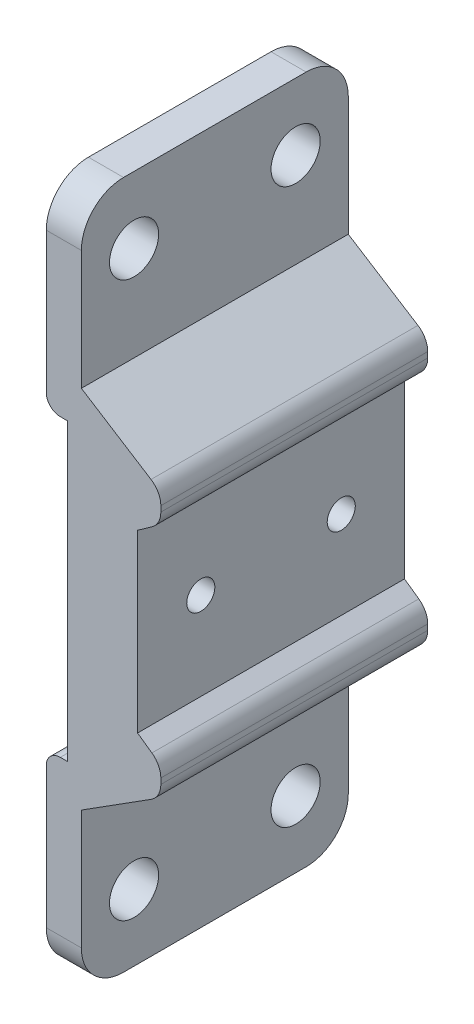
ISO-10303-21;
HEADER;
FILE_DESCRIPTION(('STEP AP214'),'2;1');
FILE_NAME('part.step','',(''),(''),'','','');
FILE_SCHEMA(('AUTOMOTIVE_DESIGN { 1 0 10303 214 1 1 1 1 }'));
ENDSEC;
DATA;
#1=APPLICATION_CONTEXT('core data for automotive mechanical design processes');
#2=APPLICATION_PROTOCOL_DEFINITION('international standard','automotive_design',2000,#1);
#3=PRODUCT_CONTEXT('',#1,'mechanical');
#4=PRODUCT('Part','Part','',(#3));
#5=PRODUCT_RELATED_PRODUCT_CATEGORY('part','',(#4));
#6=PRODUCT_DEFINITION_FORMATION('','',#4);
#7=PRODUCT_DEFINITION_CONTEXT('part definition',#1,'design');
#8=PRODUCT_DEFINITION('design','',#6,#7);
#9=PRODUCT_DEFINITION_SHAPE('','',#8);
#10=(LENGTH_UNIT() NAMED_UNIT(*) SI_UNIT(.MILLI.,.METRE.));
#11=(NAMED_UNIT(*) PLANE_ANGLE_UNIT() SI_UNIT($,.RADIAN.));
#12=(NAMED_UNIT(*) SI_UNIT($,.STERADIAN.) SOLID_ANGLE_UNIT());
#13=UNCERTAINTY_MEASURE_WITH_UNIT(LENGTH_MEASURE(1.E-05),#10,'distance_accuracy_value','');
#14=(GEOMETRIC_REPRESENTATION_CONTEXT(3) GLOBAL_UNCERTAINTY_ASSIGNED_CONTEXT((#13)) GLOBAL_UNIT_ASSIGNED_CONTEXT((#10,
#11,#12)) REPRESENTATION_CONTEXT('',''));
#15=CARTESIAN_POINT('',(0.,0.,0.));
#16=DIRECTION('',(0.,0.,1.));
#17=DIRECTION('',(1.,0.,0.));
#18=AXIS2_PLACEMENT_3D('',#15,#16,#17);
#19=CARTESIAN_POINT('',(3.00000000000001,-21.,19.));
#20=DIRECTION('',(1.,0.,0.));
#21=DIRECTION('',(0.,0.,-1.));
#22=AXIS2_PLACEMENT_3D('',#19,#20,#21);
#23=PLANE('',#22);
#24=DIRECTION('',(0.,1.,0.));
#25=VECTOR('',#24,1.);
#26=CARTESIAN_POINT('',(3.00000000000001,-21.,16.));
#27=LINE('',#26,#25);
#28=CARTESIAN_POINT('',(3.00000000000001,-21.,16.));
#29=VERTEX_POINT('',#28);
#30=CARTESIAN_POINT('',(3.00000000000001,21.,16.));
#31=VERTEX_POINT('',#30);
#32=EDGE_CURVE('E247',#29,#31,#27,.T.);
#33=ORIENTED_EDGE('',*,*,#32,.F.);
#34=DIRECTION('',(0.,0.,-1.));
#35=VECTOR('',#34,1.);
#36=CARTESIAN_POINT('',(3.00000000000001,-21.,19.));
#37=LINE('',#36,#35);
#38=CARTESIAN_POINT('',(3.00000000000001,-21.,19.));
#39=VERTEX_POINT('',#38);
#40=EDGE_CURVE('E257',#39,#29,#37,.T.);
#41=ORIENTED_EDGE('',*,*,#40,.F.);
#42=DIRECTION('',(0.,-1.,0.));
#43=VECTOR('',#42,1.);
#44=CARTESIAN_POINT('',(3.00000000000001,-21.,19.));
#45=LINE('',#44,#43);
#46=CARTESIAN_POINT('',(3.00000000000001,21.,19.));
#47=VERTEX_POINT('',#46);
#48=EDGE_CURVE('E433',#47,#39,#45,.T.);
#49=ORIENTED_EDGE('',*,*,#48,.F.);
#50=DIRECTION('',(0.,0.,-1.));
#51=VECTOR('',#50,1.);
#52=CARTESIAN_POINT('',(3.00000000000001,21.,19.));
#53=LINE('',#52,#51);
#54=EDGE_CURVE('E260',#47,#31,#53,.T.);
#55=ORIENTED_EDGE('',*,*,#54,.T.);
#56=EDGE_LOOP('',(#33,#41,#49,#55));
#57=FACE_BOUND('',#56,.T.);
#58=ADVANCED_FACE('F33',(#57),#23,.F.);
#59=CARTESIAN_POINT('',(0.,21.,19.));
#60=DIRECTION('',(1.,0.,0.));
#61=DIRECTION('',(0.,1.,0.));
#62=AXIS2_PLACEMENT_3D('',#59,#60,#61);
#63=PLANE('',#62);
#64=CARTESIAN_POINT('',(0.,39.5,-11.5));
#65=DIRECTION('',(-1.,0.,0.));
#66=DIRECTION('',(0.,1.,0.));
#67=AXIS2_PLACEMENT_3D('',#64,#65,#66);
#68=CIRCLE('',#67,3.5);
#69=CARTESIAN_POINT('',(0.,43.,-11.5));
#70=VERTEX_POINT('',#69);
#71=EDGE_CURVE('E312',#70,#70,#68,.T.);
#72=ORIENTED_EDGE('',*,*,#71,.F.);
#73=EDGE_LOOP('',(#72));
#74=FACE_BOUND('',#73,.T.);
#75=CARTESIAN_POINT('',(0.,39.5,11.5));
#76=DIRECTION('',(-1.,0.,0.));
#77=DIRECTION('',(0.,-1.,0.));
#78=AXIS2_PLACEMENT_3D('',#75,#76,#77);
#79=CIRCLE('',#78,3.5);
#80=CARTESIAN_POINT('',(0.,36.,11.5));
#81=VERTEX_POINT('',#80);
#82=EDGE_CURVE('E304',#81,#81,#79,.T.);
#83=ORIENTED_EDGE('',*,*,#82,.F.);
#84=EDGE_LOOP('',(#83));
#85=FACE_BOUND('',#84,.T.);
#86=DIRECTION('',(0.,-1.,0.));
#87=VECTOR('',#86,1.);
#88=CARTESIAN_POINT('',(0.,21.,19.));
#89=LINE('',#88,#87);
#90=CARTESIAN_POINT('',(0.,43.,19.));
#91=VERTEX_POINT('',#90);
#92=CARTESIAN_POINT('',(0.,23.,19.));
#93=VERTEX_POINT('',#92);
#94=EDGE_CURVE('E437',#91,#93,#89,.T.);
#95=ORIENTED_EDGE('',*,*,#94,.F.);
#96=CARTESIAN_POINT('',(0.,43.,13.));
#97=DIRECTION('',(1.,0.,0.));
#98=DIRECTION('',(0.,1.,0.));
#99=AXIS2_PLACEMENT_3D('',#96,#97,#98);
#100=CIRCLE('',#99,6.);
#101=CARTESIAN_POINT('',(0.,49.,13.));
#102=VERTEX_POINT('',#101);
#103=EDGE_CURVE('E328',#91,#102,#100,.F.);
#104=ORIENTED_EDGE('',*,*,#103,.T.);
#105=DIRECTION('',(0.,0.,-1.));
#106=VECTOR('',#105,1.);
#107=CARTESIAN_POINT('',(0.,49.,19.));
#108=LINE('',#107,#106);
#109=CARTESIAN_POINT('',(0.,49.,-13.));
#110=VERTEX_POINT('',#109);
#111=EDGE_CURVE('E399',#102,#110,#108,.T.);
#112=ORIENTED_EDGE('',*,*,#111,.T.);
#113=CARTESIAN_POINT('',(0.,43.,-13.));
#114=DIRECTION('',(1.,0.,0.));
#115=DIRECTION('',(0.,1.,0.));
#116=AXIS2_PLACEMENT_3D('',#113,#114,#115);
#117=CIRCLE('',#116,6.);
#118=CARTESIAN_POINT('',(0.,43.,-19.));
#119=VERTEX_POINT('',#118);
#120=EDGE_CURVE('E326',#110,#119,#117,.F.);
#121=ORIENTED_EDGE('',*,*,#120,.T.);
#122=DIRECTION('',(0.,-1.,0.));
#123=VECTOR('',#122,1.);
#124=CARTESIAN_POINT('',(0.,21.,-19.));
#125=LINE('',#124,#123);
#126=CARTESIAN_POINT('',(0.,23.,-19.));
#127=VERTEX_POINT('',#126);
#128=EDGE_CURVE('E475',#119,#127,#125,.T.);
#129=ORIENTED_EDGE('',*,*,#128,.T.);
#130=DIRECTION('',(0.,0.,-1.));
#131=VECTOR('',#130,1.);
#132=CARTESIAN_POINT('',(0.,23.,19.));
#133=LINE('',#132,#131);
#134=EDGE_CURVE('E285',#127,#93,#133,.F.);
#135=ORIENTED_EDGE('',*,*,#134,.T.);
#136=EDGE_LOOP('',(#95,#104,#112,#121,#129,#135));
#137=FACE_BOUND('',#136,.T.);
#138=ADVANCED_FACE('F35',(#74,#85,#137),#63,.F.);
#139=CARTESIAN_POINT('',(3.00000000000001,21.,19.));
#140=DIRECTION('',(0.,1.,0.));
#141=DIRECTION('',(-1.,0.,0.));
#142=AXIS2_PLACEMENT_3D('',#139,#140,#141);
#143=PLANE('',#142);
#144=DIRECTION('',(1.,0.,0.));
#145=VECTOR('',#144,1.);
#146=CARTESIAN_POINT('',(3.00000000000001,21.,19.));
#147=LINE('',#146,#145);
#148=CARTESIAN_POINT('',(2.,21.,19.));
#149=VERTEX_POINT('',#148);
#150=EDGE_CURVE('E435',#149,#47,#147,.T.);
#151=ORIENTED_EDGE('',*,*,#150,.F.);
#152=DIRECTION('',(0.,0.,-1.));
#153=VECTOR('',#152,1.);
#154=CARTESIAN_POINT('',(2.,21.,19.));
#155=LINE('',#154,#153);
#156=CARTESIAN_POINT('',(2.,21.,-19.));
#157=VERTEX_POINT('',#156);
#158=EDGE_CURVE('E277',#149,#157,#155,.T.);
#159=ORIENTED_EDGE('',*,*,#158,.T.);
#160=DIRECTION('',(1.,0.,0.));
#161=VECTOR('',#160,1.);
#162=CARTESIAN_POINT('',(3.00000000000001,21.,-19.));
#163=LINE('',#162,#161);
#164=CARTESIAN_POINT('',(3.00000000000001,21.,-19.));
#165=VERTEX_POINT('',#164);
#166=EDGE_CURVE('E473',#157,#165,#163,.T.);
#167=ORIENTED_EDGE('',*,*,#166,.T.);
#168=CARTESIAN_POINT('',(3.00000000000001,21.,-16.));
#169=VERTEX_POINT('',#168);
#170=EDGE_CURVE('E268',#169,#165,#53,.T.);
#171=ORIENTED_EDGE('',*,*,#170,.F.);
#172=DIRECTION('',(0.,0.,1.));
#173=VECTOR('',#172,1.);
#174=CARTESIAN_POINT('',(3.00000000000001,21.,-16.));
#175=LINE('',#174,#173);
#176=EDGE_CURVE('E262',#169,#31,#175,.T.);
#177=ORIENTED_EDGE('',*,*,#176,.T.);
#178=ORIENTED_EDGE('',*,*,#54,.F.);
#179=EDGE_LOOP('',(#151,#159,#167,#171,#177,#178));
#180=FACE_BOUND('',#179,.T.);
#181=ADVANCED_FACE('F598',(#180),#143,.F.);
#182=CARTESIAN_POINT('',(3.00000000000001,-21.,-16.));
#183=VERTEX_POINT('',#182);
#184=CARTESIAN_POINT('',(3.00000000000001,-21.,-19.));
#185=VERTEX_POINT('',#184);
#186=EDGE_CURVE('E269',#183,#185,#37,.T.);
#187=ORIENTED_EDGE('',*,*,#186,.F.);
#188=DIRECTION('',(0.,1.,0.));
#189=VECTOR('',#188,1.);
#190=CARTESIAN_POINT('',(3.00000000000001,-21.,-16.));
#191=LINE('',#190,#189);
#192=EDGE_CURVE('E261',#183,#169,#191,.T.);
#193=ORIENTED_EDGE('',*,*,#192,.T.);
#194=ORIENTED_EDGE('',*,*,#170,.T.);
#195=DIRECTION('',(0.,-1.,0.));
#196=VECTOR('',#195,1.);
#197=CARTESIAN_POINT('',(3.00000000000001,-21.,-19.));
#198=LINE('',#197,#196);
#199=EDGE_CURVE('E470',#165,#185,#198,.T.);
#200=ORIENTED_EDGE('',*,*,#199,.T.);
#201=EDGE_LOOP('',(#187,#193,#194,#200));
#202=FACE_BOUND('',#201,.T.);
#203=ADVANCED_FACE('F621',(#202),#23,.F.);
#204=CARTESIAN_POINT('',(3.00000000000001,-21.,19.));
#205=DIRECTION('',(0.,-1.,0.));
#206=DIRECTION('',(1.,0.,0.));
#207=AXIS2_PLACEMENT_3D('',#204,#205,#206);
#208=PLANE('',#207);
#209=DIRECTION('',(-1.,0.,0.));
#210=VECTOR('',#209,1.);
#211=CARTESIAN_POINT('',(3.00000000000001,-21.,-19.));
#212=LINE('',#211,#210);
#213=CARTESIAN_POINT('',(2.,-21.,-19.));
#214=VERTEX_POINT('',#213);
#215=EDGE_CURVE('E468',#185,#214,#212,.T.);
#216=ORIENTED_EDGE('',*,*,#215,.T.);
#217=DIRECTION('',(0.,0.,-1.));
#218=VECTOR('',#217,1.);
#219=CARTESIAN_POINT('',(2.,-21.,19.));
#220=LINE('',#219,#218);
#221=CARTESIAN_POINT('',(2.,-21.,19.));
#222=VERTEX_POINT('',#221);
#223=EDGE_CURVE('E295',#214,#222,#220,.F.);
#224=ORIENTED_EDGE('',*,*,#223,.T.);
#225=DIRECTION('',(-1.,0.,0.));
#226=VECTOR('',#225,1.);
#227=CARTESIAN_POINT('',(3.00000000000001,-21.,19.));
#228=LINE('',#227,#226);
#229=EDGE_CURVE('E267',#39,#222,#228,.T.);
#230=ORIENTED_EDGE('',*,*,#229,.F.);
#231=ORIENTED_EDGE('',*,*,#40,.T.);
#232=DIRECTION('',(0.,0.,1.));
#233=VECTOR('',#232,1.);
#234=CARTESIAN_POINT('',(3.00000000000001,-21.,-16.));
#235=LINE('',#234,#233);
#236=EDGE_CURVE('E230',#183,#29,#235,.T.);
#237=ORIENTED_EDGE('',*,*,#236,.F.);
#238=ORIENTED_EDGE('',*,*,#186,.T.);
#239=EDGE_LOOP('',(#216,#224,#230,#231,#237,#238));
#240=FACE_BOUND('',#239,.T.);
#241=ADVANCED_FACE('F265',(#240),#208,.F.);
#242=CARTESIAN_POINT('',(0.,-21.,19.));
#243=DIRECTION('',(1.,0.,0.));
#244=DIRECTION('',(0.,1.,0.));
#245=AXIS2_PLACEMENT_3D('',#242,#243,#244);
#246=PLANE('',#245);
#247=CARTESIAN_POINT('',(0.,-39.5,-11.5));
#248=DIRECTION('',(-1.,0.,0.));
#249=DIRECTION('',(0.,1.,0.));
#250=AXIS2_PLACEMENT_3D('',#247,#248,#249);
#251=CIRCLE('',#250,3.5);
#252=CARTESIAN_POINT('',(0.,-36.,-11.5));
#253=VERTEX_POINT('',#252);
#254=EDGE_CURVE('E320',#253,#253,#251,.T.);
#255=ORIENTED_EDGE('',*,*,#254,.F.);
#256=EDGE_LOOP('',(#255));
#257=FACE_BOUND('',#256,.T.);
#258=CARTESIAN_POINT('',(0.,-39.5,11.5));
#259=DIRECTION('',(-1.,0.,0.));
#260=DIRECTION('',(0.,-1.,0.));
#261=AXIS2_PLACEMENT_3D('',#258,#259,#260);
#262=CIRCLE('',#261,3.5);
#263=CARTESIAN_POINT('',(0.,-43.,11.5));
#264=VERTEX_POINT('',#263);
#265=EDGE_CURVE('E308',#264,#264,#262,.T.);
#266=ORIENTED_EDGE('',*,*,#265,.F.);
#267=EDGE_LOOP('',(#266));
#268=FACE_BOUND('',#267,.T.);
#269=DIRECTION('',(0.,0.,-1.));
#270=VECTOR('',#269,1.);
#271=CARTESIAN_POINT('',(0.,-49.,19.));
#272=LINE('',#271,#270);
#273=CARTESIAN_POINT('',(0.,-49.,13.));
#274=VERTEX_POINT('',#273);
#275=CARTESIAN_POINT('',(0.,-49.,-13.));
#276=VERTEX_POINT('',#275);
#277=EDGE_CURVE('E273',#274,#276,#272,.T.);
#278=ORIENTED_EDGE('',*,*,#277,.F.);
#279=CARTESIAN_POINT('',(0.,-43.,13.));
#280=DIRECTION('',(1.,0.,0.));
#281=DIRECTION('',(0.,1.,0.));
#282=AXIS2_PLACEMENT_3D('',#279,#280,#281);
#283=CIRCLE('',#282,6.);
#284=CARTESIAN_POINT('',(0.,-43.,19.));
#285=VERTEX_POINT('',#284);
#286=EDGE_CURVE('E11',#274,#285,#283,.F.);
#287=ORIENTED_EDGE('',*,*,#286,.T.);
#288=DIRECTION('',(0.,-1.,0.));
#289=VECTOR('',#288,1.);
#290=CARTESIAN_POINT('',(0.,-21.,19.));
#291=LINE('',#290,#289);
#292=CARTESIAN_POINT('',(0.,-23.,19.));
#293=VERTEX_POINT('',#292);
#294=EDGE_CURVE('E429',#293,#285,#291,.T.);
#295=ORIENTED_EDGE('',*,*,#294,.F.);
#296=DIRECTION('',(0.,0.,-1.));
#297=VECTOR('',#296,1.);
#298=CARTESIAN_POINT('',(0.,-23.,19.));
#299=LINE('',#298,#297);
#300=CARTESIAN_POINT('',(0.,-23.,-19.));
#301=VERTEX_POINT('',#300);
#302=EDGE_CURVE('E292',#293,#301,#299,.T.);
#303=ORIENTED_EDGE('',*,*,#302,.T.);
#304=DIRECTION('',(0.,-1.,0.));
#305=VECTOR('',#304,1.);
#306=CARTESIAN_POINT('',(0.,-21.,-19.));
#307=LINE('',#306,#305);
#308=CARTESIAN_POINT('',(0.,-43.,-19.));
#309=VERTEX_POINT('',#308);
#310=EDGE_CURVE('E466',#301,#309,#307,.T.);
#311=ORIENTED_EDGE('',*,*,#310,.T.);
#312=CARTESIAN_POINT('',(0.,-43.,-13.));
#313=DIRECTION('',(1.,0.,0.));
#314=DIRECTION('',(0.,1.,0.));
#315=AXIS2_PLACEMENT_3D('',#312,#313,#314);
#316=CIRCLE('',#315,6.);
#317=EDGE_CURVE('E41',#309,#276,#316,.F.);
#318=ORIENTED_EDGE('',*,*,#317,.T.);
#319=EDGE_LOOP('',(#278,#287,#295,#303,#311,#318));
#320=FACE_BOUND('',#319,.T.);
#321=ADVANCED_FACE('F509',(#257,#268,#320),#246,.F.);
#322=CARTESIAN_POINT('',(0.,-49.,19.));
#323=DIRECTION('',(0.,1.,0.));
#324=DIRECTION('',(0.,0.,1.));
#325=AXIS2_PLACEMENT_3D('',#322,#323,#324);
#326=PLANE('',#325);
#327=DIRECTION('',(0.,0.,-1.));
#328=VECTOR('',#327,1.);
#329=CARTESIAN_POINT('',(5.00000000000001,-49.,19.));
#330=LINE('',#329,#328);
#331=CARTESIAN_POINT('',(5.00000000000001,-49.,13.));
#332=VERTEX_POINT('',#331);
#333=CARTESIAN_POINT('',(5.00000000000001,-49.,-13.));
#334=VERTEX_POINT('',#333);
#335=EDGE_CURVE('E353',#332,#334,#330,.T.);
#336=ORIENTED_EDGE('',*,*,#335,.F.);
#337=DIRECTION('',(1.,0.,0.));
#338=VECTOR('',#337,1.);
#339=CARTESIAN_POINT('',(0.,-49.,13.));
#340=LINE('',#339,#338);
#341=EDGE_CURVE('E54',#332,#274,#340,.F.);
#342=ORIENTED_EDGE('',*,*,#341,.T.);
#343=ORIENTED_EDGE('',*,*,#277,.T.);
#344=DIRECTION('',(1.,0.,0.));
#345=VECTOR('',#344,1.);
#346=CARTESIAN_POINT('',(0.,-49.,-13.));
#347=LINE('',#346,#345);
#348=EDGE_CURVE('E347',#276,#334,#347,.T.);
#349=ORIENTED_EDGE('',*,*,#348,.T.);
#350=EDGE_LOOP('',(#336,#342,#343,#349));
#351=FACE_BOUND('',#350,.T.);
#352=ADVANCED_FACE('F352',(#351),#326,.F.);
#353=CARTESIAN_POINT('',(5.00000000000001,-49.,19.));
#354=DIRECTION('',(-1.,0.,0.));
#355=DIRECTION('',(0.,-1.,0.));
#356=AXIS2_PLACEMENT_3D('',#353,#354,#355);
#357=PLANE('',#356);
#358=CARTESIAN_POINT('',(5.,-39.5,-11.5));
#359=DIRECTION('',(-1.,0.,0.));
#360=DIRECTION('',(0.,-1.,0.));
#361=AXIS2_PLACEMENT_3D('',#358,#359,#360);
#362=CIRCLE('',#361,3.5);
#363=CARTESIAN_POINT('',(5.,-43.,-11.5));
#364=VERTEX_POINT('',#363);
#365=EDGE_CURVE('E317',#364,#364,#362,.T.);
#366=ORIENTED_EDGE('',*,*,#365,.T.);
#367=EDGE_LOOP('',(#366));
#368=FACE_BOUND('',#367,.T.);
#369=CARTESIAN_POINT('',(5.,-39.5,11.5));
#370=DIRECTION('',(-1.,0.,0.));
#371=DIRECTION('',(0.,-1.,0.));
#372=AXIS2_PLACEMENT_3D('',#369,#370,#371);
#373=CIRCLE('',#372,3.5);
#374=CARTESIAN_POINT('',(5.,-43.,11.5));
#375=VERTEX_POINT('',#374);
#376=EDGE_CURVE('E305',#375,#375,#373,.T.);
#377=ORIENTED_EDGE('',*,*,#376,.T.);
#378=EDGE_LOOP('',(#377));
#379=FACE_BOUND('',#378,.T.);
#380=DIRECTION('',(0.,1.,0.));
#381=VECTOR('',#380,1.);
#382=CARTESIAN_POINT('',(5.00000000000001,-49.,19.));
#383=LINE('',#382,#381);
#384=CARTESIAN_POINT('',(5.00000000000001,-43.,19.));
#385=VERTEX_POINT('',#384);
#386=CARTESIAN_POINT('',(5.00000000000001,-26.,19.));
#387=VERTEX_POINT('',#386);
#388=EDGE_CURVE('E427',#385,#387,#383,.T.);
#389=ORIENTED_EDGE('',*,*,#388,.F.);
#390=CARTESIAN_POINT('',(5.00000000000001,-43.,13.));
#391=DIRECTION('',(-1.,0.,0.));
#392=DIRECTION('',(0.,-1.,0.));
#393=AXIS2_PLACEMENT_3D('',#390,#391,#392);
#394=CIRCLE('',#393,6.);
#395=EDGE_CURVE('E345',#385,#332,#394,.F.);
#396=ORIENTED_EDGE('',*,*,#395,.T.);
#397=ORIENTED_EDGE('',*,*,#335,.T.);
#398=CARTESIAN_POINT('',(5.00000000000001,-43.,-13.));
#399=DIRECTION('',(-1.,0.,0.));
#400=DIRECTION('',(0.,-1.,0.));
#401=AXIS2_PLACEMENT_3D('',#398,#399,#400);
#402=CIRCLE('',#401,6.);
#403=CARTESIAN_POINT('',(5.00000000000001,-43.,-19.));
#404=VERTEX_POINT('',#403);
#405=EDGE_CURVE('E343',#334,#404,#402,.F.);
#406=ORIENTED_EDGE('',*,*,#405,.T.);
#407=DIRECTION('',(0.,1.,0.));
#408=VECTOR('',#407,1.);
#409=CARTESIAN_POINT('',(5.00000000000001,-49.,-19.));
#410=LINE('',#409,#408);
#411=CARTESIAN_POINT('',(5.00000000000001,-26.,-19.));
#412=VERTEX_POINT('',#411);
#413=EDGE_CURVE('E464',#404,#412,#410,.T.);
#414=ORIENTED_EDGE('',*,*,#413,.T.);
#415=DIRECTION('',(0.,0.,-1.));
#416=VECTOR('',#415,1.);
#417=CARTESIAN_POINT('',(5.00000000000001,-26.,19.));
#418=LINE('',#417,#416);
#419=EDGE_CURVE('E359',#387,#412,#418,.T.);
#420=ORIENTED_EDGE('',*,*,#419,.F.);
#421=EDGE_LOOP('',(#389,#396,#397,#406,#414,#420));
#422=FACE_BOUND('',#421,.T.);
#423=ADVANCED_FACE('F357',(#368,#379,#422),#357,.F.);
#424=CARTESIAN_POINT('',(5.00000000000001,-26.,19.));
#425=DIRECTION('',(-0.535052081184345,0.844819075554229,0.));
#426=DIRECTION('',(-0.844819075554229,-0.535052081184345,0.));
#427=AXIS2_PLACEMENT_3D('',#424,#425,#426);
#428=PLANE('',#427);
#429=DIRECTION('',(0.844819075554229,0.535052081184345,0.));
#430=VECTOR('',#429,1.);
#431=CARTESIAN_POINT('',(5.00000000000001,-26.,-19.));
#432=LINE('',#431,#430);
#433=CARTESIAN_POINT('',(14.9168971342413,-19.7192984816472,-19.));
#434=VERTEX_POINT('',#433);
#435=EDGE_CURVE('E462',#412,#434,#432,.T.);
#436=ORIENTED_EDGE('',*,*,#435,.T.);
#437=DIRECTION('',(0.,0.,-1.));
#438=VECTOR('',#437,1.);
#439=CARTESIAN_POINT('',(14.9168971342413,-19.7192984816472,19.));
#440=LINE('',#439,#438);
#441=CARTESIAN_POINT('',(14.9168971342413,-19.7192984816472,19.));
#442=VERTEX_POINT('',#441);
#443=EDGE_CURVE('E361',#442,#434,#440,.T.);
#444=ORIENTED_EDGE('',*,*,#443,.F.);
#445=DIRECTION('',(0.844819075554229,0.535052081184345,0.));
#446=VECTOR('',#445,1.);
#447=CARTESIAN_POINT('',(5.00000000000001,-26.,19.));
#448=LINE('',#447,#446);
#449=EDGE_CURVE('E425',#387,#442,#448,.T.);
#450=ORIENTED_EDGE('',*,*,#449,.F.);
#451=ORIENTED_EDGE('',*,*,#419,.T.);
#452=EDGE_LOOP('',(#436,#444,#450,#451));
#453=FACE_BOUND('',#452,.T.);
#454=ADVANCED_FACE('F526',(#453),#428,.F.);
#455=CARTESIAN_POINT('',(13.3117408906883,-17.1848412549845,19.));
#456=DIRECTION('',(0.,0.,-1.));
#457=DIRECTION('',(-1.,0.,0.));
#458=AXIS2_PLACEMENT_3D('',#455,#456,#457);
#459=CYLINDRICAL_SURFACE('',#458,3.);
#460=CARTESIAN_POINT('',(13.3117408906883,-17.1848412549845,-19.));
#461=DIRECTION('',(0.,0.,1.));
#462=DIRECTION('',(-1.,0.,0.));
#463=AXIS2_PLACEMENT_3D('',#460,#461,#462);
#464=CIRCLE('',#463,3.);
#465=CARTESIAN_POINT('',(16.3117408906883,-17.1848412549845,-19.));
#466=VERTEX_POINT('',#465);
#467=EDGE_CURVE('E460',#434,#466,#464,.T.);
#468=ORIENTED_EDGE('',*,*,#467,.T.);
#469=DIRECTION('',(0.,0.,-1.));
#470=VECTOR('',#469,1.);
#471=CARTESIAN_POINT('',(16.3117408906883,-17.1848412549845,19.));
#472=LINE('',#471,#470);
#473=CARTESIAN_POINT('',(16.3117408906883,-17.1848412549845,19.));
#474=VERTEX_POINT('',#473);
#475=EDGE_CURVE('E366',#474,#466,#472,.T.);
#476=ORIENTED_EDGE('',*,*,#475,.F.);
#477=CARTESIAN_POINT('',(13.3117408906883,-17.1848412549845,19.));
#478=DIRECTION('',(0.,0.,1.));
#479=DIRECTION('',(-1.,0.,0.));
#480=AXIS2_PLACEMENT_3D('',#477,#478,#479);
#481=CIRCLE('',#480,3.);
#482=EDGE_CURVE('E423',#442,#474,#481,.T.);
#483=ORIENTED_EDGE('',*,*,#482,.F.);
#484=ORIENTED_EDGE('',*,*,#443,.T.);
#485=EDGE_LOOP('',(#468,#476,#483,#484));
#486=FACE_BOUND('',#485,.T.);
#487=ADVANCED_FACE('F532',(#486),#459,.T.);
#488=CARTESIAN_POINT('',(16.3117408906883,-17.1848412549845,19.));
#489=DIRECTION('',(-1.,0.,0.));
#490=DIRECTION('',(0.,0.,1.));
#491=AXIS2_PLACEMENT_3D('',#488,#489,#490);
#492=PLANE('',#491);
#493=DIRECTION('',(0.,1.,0.));
#494=VECTOR('',#493,1.);
#495=CARTESIAN_POINT('',(16.3117408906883,-17.1848412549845,-19.));
#496=LINE('',#495,#494);
#497=CARTESIAN_POINT('',(16.3117408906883,-16.3910567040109,-19.));
#498=VERTEX_POINT('',#497);
#499=EDGE_CURVE('E458',#466,#498,#496,.T.);
#500=ORIENTED_EDGE('',*,*,#499,.T.);
#501=DIRECTION('',(0.,0.,-1.));
#502=VECTOR('',#501,1.);
#503=CARTESIAN_POINT('',(16.3117408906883,-16.3910567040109,19.));
#504=LINE('',#503,#502);
#505=CARTESIAN_POINT('',(16.3117408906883,-16.3910567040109,19.));
#506=VERTEX_POINT('',#505);
#507=EDGE_CURVE('E369',#506,#498,#504,.T.);
#508=ORIENTED_EDGE('',*,*,#507,.F.);
#509=DIRECTION('',(0.,1.,0.));
#510=VECTOR('',#509,1.);
#511=CARTESIAN_POINT('',(16.3117408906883,-17.1848412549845,19.));
#512=LINE('',#511,#510);
#513=EDGE_CURVE('E421',#474,#506,#512,.T.);
#514=ORIENTED_EDGE('',*,*,#513,.F.);
#515=ORIENTED_EDGE('',*,*,#475,.T.);
#516=EDGE_LOOP('',(#500,#508,#514,#515));
#517=FACE_BOUND('',#516,.T.);
#518=ADVANCED_FACE('F536',(#517),#492,.F.);
#519=CARTESIAN_POINT('',(13.3117408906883,-16.3910567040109,19.));
#520=DIRECTION('',(0.,0.,-1.));
#521=DIRECTION('',(-1.,0.,0.));
#522=AXIS2_PLACEMENT_3D('',#519,#520,#521);
#523=CYLINDRICAL_SURFACE('',#522,3.);
#524=CARTESIAN_POINT('',(13.3117408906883,-16.3910567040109,-19.));
#525=DIRECTION('',(0.,0.,1.));
#526=DIRECTION('',(1.,0.,0.));
#527=AXIS2_PLACEMENT_3D('',#524,#525,#526);
#528=CIRCLE('',#527,3.);
#529=CARTESIAN_POINT('',(15.0409000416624,-13.9395248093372,-19.));
#530=VERTEX_POINT('',#529);
#531=EDGE_CURVE('E456',#498,#530,#528,.T.);
#532=ORIENTED_EDGE('',*,*,#531,.T.);
#533=DIRECTION('',(0.,0.,-1.));
#534=VECTOR('',#533,1.);
#535=CARTESIAN_POINT('',(15.0409000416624,-13.9395248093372,19.));
#536=LINE('',#535,#534);
#537=CARTESIAN_POINT('',(15.0409000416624,-13.9395248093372,19.));
#538=VERTEX_POINT('',#537);
#539=EDGE_CURVE('E372',#538,#530,#536,.T.);
#540=ORIENTED_EDGE('',*,*,#539,.F.);
#541=CARTESIAN_POINT('',(13.3117408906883,-16.3910567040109,19.));
#542=DIRECTION('',(0.,0.,1.));
#543=DIRECTION('',(1.,0.,0.));
#544=AXIS2_PLACEMENT_3D('',#541,#542,#543);
#545=CIRCLE('',#544,3.);
#546=EDGE_CURVE('E419',#506,#538,#545,.T.);
#547=ORIENTED_EDGE('',*,*,#546,.F.);
#548=ORIENTED_EDGE('',*,*,#507,.T.);
#549=EDGE_LOOP('',(#532,#540,#547,#548));
#550=FACE_BOUND('',#549,.T.);
#551=ADVANCED_FACE('F541',(#550),#523,.T.);
#552=CARTESIAN_POINT('',(15.0409000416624,-13.9395248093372,19.));
#553=DIRECTION('',(-0.57638638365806,-0.817177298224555,0.));
#554=DIRECTION('',(0.817177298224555,-0.57638638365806,0.));
#555=AXIS2_PLACEMENT_3D('',#552,#553,#554);
#556=PLANE('',#555);
#557=DIRECTION('',(-0.817177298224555,0.57638638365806,0.));
#558=VECTOR('',#557,1.);
#559=CARTESIAN_POINT('',(15.0409000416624,-13.9395248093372,-19.));
#560=LINE('',#559,#558);
#561=CARTESIAN_POINT('',(13.,-12.5,-19.));
#562=VERTEX_POINT('',#561);
#563=EDGE_CURVE('E454',#530,#562,#560,.T.);
#564=ORIENTED_EDGE('',*,*,#563,.T.);
#565=DIRECTION('',(0.,0.,-1.));
#566=VECTOR('',#565,1.);
#567=CARTESIAN_POINT('',(13.,-12.5,19.));
#568=LINE('',#567,#566);
#569=CARTESIAN_POINT('',(13.,-12.5,19.));
#570=VERTEX_POINT('',#569);
#571=EDGE_CURVE('E375',#570,#562,#568,.T.);
#572=ORIENTED_EDGE('',*,*,#571,.F.);
#573=DIRECTION('',(-0.817177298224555,0.57638638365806,0.));
#574=VECTOR('',#573,1.);
#575=CARTESIAN_POINT('',(15.0409000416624,-13.9395248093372,19.));
#576=LINE('',#575,#574);
#577=EDGE_CURVE('E417',#538,#570,#576,.T.);
#578=ORIENTED_EDGE('',*,*,#577,.F.);
#579=ORIENTED_EDGE('',*,*,#539,.T.);
#580=EDGE_LOOP('',(#564,#572,#578,#579));
#581=FACE_BOUND('',#580,.T.);
#582=ADVANCED_FACE('F547',(#581),#556,.F.);
#583=CARTESIAN_POINT('',(13.,12.5,19.));
#584=DIRECTION('',(-1.,0.,0.));
#585=DIRECTION('',(0.,0.,1.));
#586=AXIS2_PLACEMENT_3D('',#583,#584,#585);
#587=PLANE('',#586);
#588=CARTESIAN_POINT('',(13.,0.,-10.));
#589=DIRECTION('',(-1.,0.,0.));
#590=DIRECTION('',(0.,0.,1.));
#591=AXIS2_PLACEMENT_3D('',#588,#589,#590);
#592=CIRCLE('',#591,2.);
#593=CARTESIAN_POINT('',(13.,0.,-8.00000000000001));
#594=VERTEX_POINT('',#593);
#595=EDGE_CURVE('E316',#594,#594,#592,.T.);
#596=ORIENTED_EDGE('',*,*,#595,.T.);
#597=EDGE_LOOP('',(#596));
#598=FACE_BOUND('',#597,.T.);
#599=CARTESIAN_POINT('',(13.,0.,10.));
#600=DIRECTION('',(-1.,0.,0.));
#601=DIRECTION('',(0.,0.,1.));
#602=AXIS2_PLACEMENT_3D('',#599,#600,#601);
#603=CIRCLE('',#602,2.);
#604=CARTESIAN_POINT('',(13.,0.,12.));
#605=VERTEX_POINT('',#604);
#606=EDGE_CURVE('E251',#605,#605,#603,.T.);
#607=ORIENTED_EDGE('',*,*,#606,.T.);
#608=EDGE_LOOP('',(#607));
#609=FACE_BOUND('',#608,.T.);
#610=DIRECTION('',(0.,1.,0.));
#611=VECTOR('',#610,1.);
#612=CARTESIAN_POINT('',(13.,12.5,-19.));
#613=LINE('',#612,#611);
#614=CARTESIAN_POINT('',(13.,12.5,-19.));
#615=VERTEX_POINT('',#614);
#616=EDGE_CURVE('E452',#562,#615,#613,.T.);
#617=ORIENTED_EDGE('',*,*,#616,.T.);
#618=DIRECTION('',(0.,0.,-1.));
#619=VECTOR('',#618,1.);
#620=CARTESIAN_POINT('',(13.,12.5,19.));
#621=LINE('',#620,#619);
#622=CARTESIAN_POINT('',(13.,12.5,19.));
#623=VERTEX_POINT('',#622);
#624=EDGE_CURVE('E378',#623,#615,#621,.T.);
#625=ORIENTED_EDGE('',*,*,#624,.F.);
#626=DIRECTION('',(0.,1.,0.));
#627=VECTOR('',#626,1.);
#628=CARTESIAN_POINT('',(13.,12.5,19.));
#629=LINE('',#628,#627);
#630=EDGE_CURVE('E415',#570,#623,#629,.T.);
#631=ORIENTED_EDGE('',*,*,#630,.F.);
#632=ORIENTED_EDGE('',*,*,#571,.T.);
#633=EDGE_LOOP('',(#617,#625,#631,#632));
#634=FACE_BOUND('',#633,.T.);
#635=ADVANCED_FACE('F551',(#598,#609,#634),#587,.F.);
#636=CARTESIAN_POINT('',(15.0409000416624,13.9395248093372,19.));
#637=DIRECTION('',(-0.57638638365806,0.817177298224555,0.));
#638=DIRECTION('',(-0.817177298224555,-0.57638638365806,0.));
#639=AXIS2_PLACEMENT_3D('',#636,#637,#638);
#640=PLANE('',#639);
#641=DIRECTION('',(0.817177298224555,0.57638638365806,0.));
#642=VECTOR('',#641,1.);
#643=CARTESIAN_POINT('',(15.0409000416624,13.9395248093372,-19.));
#644=LINE('',#643,#642);
#645=CARTESIAN_POINT('',(15.0409000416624,13.9395248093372,-19.));
#646=VERTEX_POINT('',#645);
#647=EDGE_CURVE('E450',#615,#646,#644,.T.);
#648=ORIENTED_EDGE('',*,*,#647,.T.);
#649=DIRECTION('',(0.,0.,-1.));
#650=VECTOR('',#649,1.);
#651=CARTESIAN_POINT('',(15.0409000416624,13.9395248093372,19.));
#652=LINE('',#651,#650);
#653=CARTESIAN_POINT('',(15.0409000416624,13.9395248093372,19.));
#654=VERTEX_POINT('',#653);
#655=EDGE_CURVE('E381',#654,#646,#652,.T.);
#656=ORIENTED_EDGE('',*,*,#655,.F.);
#657=DIRECTION('',(0.817177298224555,0.57638638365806,0.));
#658=VECTOR('',#657,1.);
#659=CARTESIAN_POINT('',(15.0409000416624,13.9395248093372,19.));
#660=LINE('',#659,#658);
#661=EDGE_CURVE('E413',#623,#654,#660,.T.);
#662=ORIENTED_EDGE('',*,*,#661,.F.);
#663=ORIENTED_EDGE('',*,*,#624,.T.);
#664=EDGE_LOOP('',(#648,#656,#662,#663));
#665=FACE_BOUND('',#664,.T.);
#666=ADVANCED_FACE('F556',(#665),#640,.F.);
#667=CARTESIAN_POINT('',(13.3117408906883,16.3910567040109,19.));
#668=DIRECTION('',(0.,0.,-1.));
#669=DIRECTION('',(-1.,0.,0.));
#670=AXIS2_PLACEMENT_3D('',#667,#668,#669);
#671=CYLINDRICAL_SURFACE('',#670,3.);
#672=CARTESIAN_POINT('',(13.3117408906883,16.3910567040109,-19.));
#673=DIRECTION('',(0.,0.,1.));
#674=DIRECTION('',(-1.,0.,0.));
#675=AXIS2_PLACEMENT_3D('',#672,#673,#674);
#676=CIRCLE('',#675,3.);
#677=CARTESIAN_POINT('',(16.3117408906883,16.3910567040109,-19.));
#678=VERTEX_POINT('',#677);
#679=EDGE_CURVE('E448',#646,#678,#676,.T.);
#680=ORIENTED_EDGE('',*,*,#679,.T.);
#681=DIRECTION('',(0.,0.,-1.));
#682=VECTOR('',#681,1.);
#683=CARTESIAN_POINT('',(16.3117408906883,16.3910567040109,19.));
#684=LINE('',#683,#682);
#685=CARTESIAN_POINT('',(16.3117408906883,16.3910567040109,19.));
#686=VERTEX_POINT('',#685);
#687=EDGE_CURVE('E384',#686,#678,#684,.T.);
#688=ORIENTED_EDGE('',*,*,#687,.F.);
#689=CARTESIAN_POINT('',(13.3117408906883,16.3910567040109,19.));
#690=DIRECTION('',(0.,0.,1.));
#691=DIRECTION('',(-1.,0.,0.));
#692=AXIS2_PLACEMENT_3D('',#689,#690,#691);
#693=CIRCLE('',#692,3.);
#694=EDGE_CURVE('E411',#654,#686,#693,.T.);
#695=ORIENTED_EDGE('',*,*,#694,.F.);
#696=ORIENTED_EDGE('',*,*,#655,.T.);
#697=EDGE_LOOP('',(#680,#688,#695,#696));
#698=FACE_BOUND('',#697,.T.);
#699=ADVANCED_FACE('F562',(#698),#671,.T.);
#700=CARTESIAN_POINT('',(16.3117408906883,17.1848412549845,19.));
#701=DIRECTION('',(-1.,0.,0.));
#702=DIRECTION('',(0.,0.,1.));
#703=AXIS2_PLACEMENT_3D('',#700,#701,#702);
#704=PLANE('',#703);
#705=DIRECTION('',(0.,1.,0.));
#706=VECTOR('',#705,1.);
#707=CARTESIAN_POINT('',(16.3117408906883,17.1848412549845,-19.));
#708=LINE('',#707,#706);
#709=CARTESIAN_POINT('',(16.3117408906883,17.1848412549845,-19.));
#710=VERTEX_POINT('',#709);
#711=EDGE_CURVE('E446',#678,#710,#708,.T.);
#712=ORIENTED_EDGE('',*,*,#711,.T.);
#713=DIRECTION('',(0.,0.,-1.));
#714=VECTOR('',#713,1.);
#715=CARTESIAN_POINT('',(16.3117408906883,17.1848412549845,19.));
#716=LINE('',#715,#714);
#717=CARTESIAN_POINT('',(16.3117408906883,17.1848412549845,19.));
#718=VERTEX_POINT('',#717);
#719=EDGE_CURVE('E387',#718,#710,#716,.T.);
#720=ORIENTED_EDGE('',*,*,#719,.F.);
#721=DIRECTION('',(0.,1.,0.));
#722=VECTOR('',#721,1.);
#723=CARTESIAN_POINT('',(16.3117408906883,17.1848412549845,19.));
#724=LINE('',#723,#722);
#725=EDGE_CURVE('E409',#686,#718,#724,.T.);
#726=ORIENTED_EDGE('',*,*,#725,.F.);
#727=ORIENTED_EDGE('',*,*,#687,.T.);
#728=EDGE_LOOP('',(#712,#720,#726,#727));
#729=FACE_BOUND('',#728,.T.);
#730=ADVANCED_FACE('F566',(#729),#704,.F.);
#731=CARTESIAN_POINT('',(13.3117408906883,17.1848412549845,19.));
#732=DIRECTION('',(0.,0.,-1.));
#733=DIRECTION('',(-1.,0.,0.));
#734=AXIS2_PLACEMENT_3D('',#731,#732,#733);
#735=CYLINDRICAL_SURFACE('',#734,3.);
#736=CARTESIAN_POINT('',(13.3117408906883,17.1848412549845,-19.));
#737=DIRECTION('',(0.,0.,1.));
#738=DIRECTION('',(1.,0.,0.));
#739=AXIS2_PLACEMENT_3D('',#736,#737,#738);
#740=CIRCLE('',#739,3.);
#741=CARTESIAN_POINT('',(14.9168971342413,19.7192984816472,-19.));
#742=VERTEX_POINT('',#741);
#743=EDGE_CURVE('E444',#710,#742,#740,.T.);
#744=ORIENTED_EDGE('',*,*,#743,.T.);
#745=DIRECTION('',(0.,0.,-1.));
#746=VECTOR('',#745,1.);
#747=CARTESIAN_POINT('',(14.9168971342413,19.7192984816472,19.));
#748=LINE('',#747,#746);
#749=CARTESIAN_POINT('',(14.9168971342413,19.7192984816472,19.));
#750=VERTEX_POINT('',#749);
#751=EDGE_CURVE('E390',#750,#742,#748,.T.);
#752=ORIENTED_EDGE('',*,*,#751,.F.);
#753=CARTESIAN_POINT('',(13.3117408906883,17.1848412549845,19.));
#754=DIRECTION('',(0.,0.,1.));
#755=DIRECTION('',(1.,0.,0.));
#756=AXIS2_PLACEMENT_3D('',#753,#754,#755);
#757=CIRCLE('',#756,3.);
#758=EDGE_CURVE('E407',#718,#750,#757,.T.);
#759=ORIENTED_EDGE('',*,*,#758,.F.);
#760=ORIENTED_EDGE('',*,*,#719,.T.);
#761=EDGE_LOOP('',(#744,#752,#759,#760));
#762=FACE_BOUND('',#761,.T.);
#763=ADVANCED_FACE('F571',(#762),#735,.T.);
#764=CARTESIAN_POINT('',(5.00000000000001,26.,19.));
#765=DIRECTION('',(-0.535052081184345,-0.844819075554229,0.));
#766=DIRECTION('',(0.844819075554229,-0.535052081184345,0.));
#767=AXIS2_PLACEMENT_3D('',#764,#765,#766);
#768=PLANE('',#767);
#769=DIRECTION('',(-0.844819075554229,0.535052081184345,0.));
#770=VECTOR('',#769,1.);
#771=CARTESIAN_POINT('',(5.00000000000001,26.,-19.));
#772=LINE('',#771,#770);
#773=CARTESIAN_POINT('',(5.00000000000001,26.,-19.));
#774=VERTEX_POINT('',#773);
#775=EDGE_CURVE('E442',#742,#774,#772,.T.);
#776=ORIENTED_EDGE('',*,*,#775,.T.);
#777=DIRECTION('',(0.,0.,-1.));
#778=VECTOR('',#777,1.);
#779=CARTESIAN_POINT('',(5.00000000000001,26.,19.));
#780=LINE('',#779,#778);
#781=CARTESIAN_POINT('',(5.00000000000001,26.,19.));
#782=VERTEX_POINT('',#781);
#783=EDGE_CURVE('E393',#782,#774,#780,.T.);
#784=ORIENTED_EDGE('',*,*,#783,.F.);
#785=DIRECTION('',(-0.844819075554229,0.535052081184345,0.));
#786=VECTOR('',#785,1.);
#787=CARTESIAN_POINT('',(5.00000000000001,26.,19.));
#788=LINE('',#787,#786);
#789=EDGE_CURVE('E405',#750,#782,#788,.T.);
#790=ORIENTED_EDGE('',*,*,#789,.F.);
#791=ORIENTED_EDGE('',*,*,#751,.T.);
#792=EDGE_LOOP('',(#776,#784,#790,#791));
#793=FACE_BOUND('',#792,.T.);
#794=ADVANCED_FACE('F577',(#793),#768,.F.);
#795=CARTESIAN_POINT('',(5.00000000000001,49.,19.));
#796=DIRECTION('',(-1.,0.,0.));
#797=DIRECTION('',(0.,-1.,0.));
#798=AXIS2_PLACEMENT_3D('',#795,#796,#797);
#799=PLANE('',#798);
#800=CARTESIAN_POINT('',(5.,39.5,-11.5));
#801=DIRECTION('',(-1.,0.,0.));
#802=DIRECTION('',(0.,-1.,0.));
#803=AXIS2_PLACEMENT_3D('',#800,#801,#802);
#804=CIRCLE('',#803,3.5);
#805=CARTESIAN_POINT('',(5.00000000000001,36.,-11.5));
#806=VERTEX_POINT('',#805);
#807=EDGE_CURVE('E309',#806,#806,#804,.T.);
#808=ORIENTED_EDGE('',*,*,#807,.T.);
#809=EDGE_LOOP('',(#808));
#810=FACE_BOUND('',#809,.T.);
#811=CARTESIAN_POINT('',(5.,39.5,11.5));
#812=DIRECTION('',(-1.,0.,0.));
#813=DIRECTION('',(0.,-1.,0.));
#814=AXIS2_PLACEMENT_3D('',#811,#812,#813);
#815=CIRCLE('',#814,3.5);
#816=CARTESIAN_POINT('',(5.00000000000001,36.,11.5));
#817=VERTEX_POINT('',#816);
#818=EDGE_CURVE('E301',#817,#817,#815,.T.);
#819=ORIENTED_EDGE('',*,*,#818,.T.);
#820=EDGE_LOOP('',(#819));
#821=FACE_BOUND('',#820,.T.);
#822=DIRECTION('',(0.,0.,-1.));
#823=VECTOR('',#822,1.);
#824=CARTESIAN_POINT('',(5.00000000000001,49.,19.));
#825=LINE('',#824,#823);
#826=CARTESIAN_POINT('',(5.00000000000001,49.,13.));
#827=VERTEX_POINT('',#826);
#828=CARTESIAN_POINT('',(5.00000000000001,49.,-13.));
#829=VERTEX_POINT('',#828);
#830=EDGE_CURVE('E396',#827,#829,#825,.T.);
#831=ORIENTED_EDGE('',*,*,#830,.F.);
#832=CARTESIAN_POINT('',(5.00000000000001,43.,13.));
#833=DIRECTION('',(-1.,0.,0.));
#834=DIRECTION('',(0.,-1.,0.));
#835=AXIS2_PLACEMENT_3D('',#832,#833,#834);
#836=CIRCLE('',#835,6.);
#837=CARTESIAN_POINT('',(5.00000000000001,43.,19.));
#838=VERTEX_POINT('',#837);
#839=EDGE_CURVE('E337',#827,#838,#836,.F.);
#840=ORIENTED_EDGE('',*,*,#839,.T.);
#841=DIRECTION('',(0.,1.,0.));
#842=VECTOR('',#841,1.);
#843=CARTESIAN_POINT('',(5.00000000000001,49.,19.));
#844=LINE('',#843,#842);
#845=EDGE_CURVE('E402',#782,#838,#844,.T.);
#846=ORIENTED_EDGE('',*,*,#845,.F.);
#847=ORIENTED_EDGE('',*,*,#783,.T.);
#848=DIRECTION('',(0.,1.,0.));
#849=VECTOR('',#848,1.);
#850=CARTESIAN_POINT('',(5.00000000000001,49.,-19.));
#851=LINE('',#850,#849);
#852=CARTESIAN_POINT('',(5.00000000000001,43.,-19.));
#853=VERTEX_POINT('',#852);
#854=EDGE_CURVE('E439',#774,#853,#851,.T.);
#855=ORIENTED_EDGE('',*,*,#854,.T.);
#856=CARTESIAN_POINT('',(5.00000000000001,43.,-13.));
#857=DIRECTION('',(-1.,0.,0.));
#858=DIRECTION('',(0.,-1.,0.));
#859=AXIS2_PLACEMENT_3D('',#856,#857,#858);
#860=CIRCLE('',#859,6.);
#861=EDGE_CURVE('E335',#853,#829,#860,.F.);
#862=ORIENTED_EDGE('',*,*,#861,.T.);
#863=EDGE_LOOP('',(#831,#840,#846,#847,#855,#862));
#864=FACE_BOUND('',#863,.T.);
#865=ADVANCED_FACE('F582',(#810,#821,#864),#799,.F.);
#866=CARTESIAN_POINT('',(0.,49.,19.));
#867=DIRECTION('',(0.,-1.,0.));
#868=DIRECTION('',(0.,0.,-1.));
#869=AXIS2_PLACEMENT_3D('',#866,#867,#868);
#870=PLANE('',#869);
#871=ORIENTED_EDGE('',*,*,#111,.F.);
#872=DIRECTION('',(-1.,0.,0.));
#873=VECTOR('',#872,1.);
#874=CARTESIAN_POINT('',(5.00000000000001,49.,13.));
#875=LINE('',#874,#873);
#876=EDGE_CURVE('E333',#102,#827,#875,.F.);
#877=ORIENTED_EDGE('',*,*,#876,.T.);
#878=ORIENTED_EDGE('',*,*,#830,.T.);
#879=DIRECTION('',(-1.,0.,0.));
#880=VECTOR('',#879,1.);
#881=CARTESIAN_POINT('',(0.,49.,-13.));
#882=LINE('',#881,#880);
#883=EDGE_CURVE('E330',#829,#110,#882,.T.);
#884=ORIENTED_EDGE('',*,*,#883,.T.);
#885=EDGE_LOOP('',(#871,#877,#878,#884));
#886=FACE_BOUND('',#885,.T.);
#887=ADVANCED_FACE('F640',(#886),#870,.F.);
#888=CARTESIAN_POINT('',(13.3117408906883,17.1848412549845,19.));
#889=DIRECTION('',(0.,0.,1.));
#890=DIRECTION('',(1.,0.,0.));
#891=AXIS2_PLACEMENT_3D('',#888,#889,#890);
#892=PLANE('',#891);
#893=ORIENTED_EDGE('',*,*,#845,.T.);
#894=DIRECTION('',(-1.,0.,0.));
#895=VECTOR('',#894,1.);
#896=CARTESIAN_POINT('',(0.,43.,19.));
#897=LINE('',#896,#895);
#898=EDGE_CURVE('E323',#838,#91,#897,.T.);
#899=ORIENTED_EDGE('',*,*,#898,.T.);
#900=ORIENTED_EDGE('',*,*,#94,.T.);
#901=CARTESIAN_POINT('',(2.00000000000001,23.,19.));
#902=DIRECTION('',(0.,0.,1.));
#903=DIRECTION('',(1.,0.,0.));
#904=AXIS2_PLACEMENT_3D('',#901,#902,#903);
#905=CIRCLE('',#904,2.);
#906=EDGE_CURVE('E290',#93,#149,#905,.T.);
#907=ORIENTED_EDGE('',*,*,#906,.T.);
#908=ORIENTED_EDGE('',*,*,#150,.T.);
#909=ORIENTED_EDGE('',*,*,#48,.T.);
#910=ORIENTED_EDGE('',*,*,#229,.T.);
#911=CARTESIAN_POINT('',(2.00000000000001,-23.,19.));
#912=DIRECTION('',(0.,0.,1.));
#913=DIRECTION('',(1.,0.,0.));
#914=AXIS2_PLACEMENT_3D('',#911,#912,#913);
#915=CIRCLE('',#914,2.);
#916=EDGE_CURVE('E288',#222,#293,#915,.T.);
#917=ORIENTED_EDGE('',*,*,#916,.T.);
#918=ORIENTED_EDGE('',*,*,#294,.T.);
#919=DIRECTION('',(1.,0.,0.));
#920=VECTOR('',#919,1.);
#921=CARTESIAN_POINT('',(5.00000000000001,-43.,19.));
#922=LINE('',#921,#920);
#923=EDGE_CURVE('E297',#285,#385,#922,.T.);
#924=ORIENTED_EDGE('',*,*,#923,.T.);
#925=ORIENTED_EDGE('',*,*,#388,.T.);
#926=ORIENTED_EDGE('',*,*,#449,.T.);
#927=ORIENTED_EDGE('',*,*,#482,.T.);
#928=ORIENTED_EDGE('',*,*,#513,.T.);
#929=ORIENTED_EDGE('',*,*,#546,.T.);
#930=ORIENTED_EDGE('',*,*,#577,.T.);
#931=ORIENTED_EDGE('',*,*,#630,.T.);
#932=ORIENTED_EDGE('',*,*,#661,.T.);
#933=ORIENTED_EDGE('',*,*,#694,.T.);
#934=ORIENTED_EDGE('',*,*,#725,.T.);
#935=ORIENTED_EDGE('',*,*,#758,.T.);
#936=ORIENTED_EDGE('',*,*,#789,.T.);
#937=EDGE_LOOP('',(#893,#899,#900,#907,#908,#909,#910,#917,#918,#924,#925,#926,#927,#928,#929,
#930,#931,#932,#933,#934,#935,#936));
#938=FACE_BOUND('',#937,.T.);
#939=ADVANCED_FACE('F520',(#938),#892,.T.);
#940=CARTESIAN_POINT('',(13.3117408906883,17.1848412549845,-19.));
#941=DIRECTION('',(0.,0.,1.));
#942=DIRECTION('',(1.,0.,0.));
#943=AXIS2_PLACEMENT_3D('',#940,#941,#942);
#944=PLANE('',#943);
#945=ORIENTED_EDGE('',*,*,#128,.F.);
#946=DIRECTION('',(-1.,0.,0.));
#947=VECTOR('',#946,1.);
#948=CARTESIAN_POINT('',(13.3117408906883,43.,-19.));
#949=LINE('',#948,#947);
#950=EDGE_CURVE('E341',#119,#853,#949,.F.);
#951=ORIENTED_EDGE('',*,*,#950,.T.);
#952=ORIENTED_EDGE('',*,*,#854,.F.);
#953=ORIENTED_EDGE('',*,*,#775,.F.);
#954=ORIENTED_EDGE('',*,*,#743,.F.);
#955=ORIENTED_EDGE('',*,*,#711,.F.);
#956=ORIENTED_EDGE('',*,*,#679,.F.);
#957=ORIENTED_EDGE('',*,*,#647,.F.);
#958=ORIENTED_EDGE('',*,*,#616,.F.);
#959=ORIENTED_EDGE('',*,*,#563,.F.);
#960=ORIENTED_EDGE('',*,*,#531,.F.);
#961=ORIENTED_EDGE('',*,*,#499,.F.);
#962=ORIENTED_EDGE('',*,*,#467,.F.);
#963=ORIENTED_EDGE('',*,*,#435,.F.);
#964=ORIENTED_EDGE('',*,*,#413,.F.);
#965=DIRECTION('',(1.,0.,0.));
#966=VECTOR('',#965,1.);
#967=CARTESIAN_POINT('',(13.3117408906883,-43.,-19.));
#968=LINE('',#967,#966);
#969=EDGE_CURVE('E339',#404,#309,#968,.F.);
#970=ORIENTED_EDGE('',*,*,#969,.T.);
#971=ORIENTED_EDGE('',*,*,#310,.F.);
#972=CARTESIAN_POINT('',(2.00000000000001,-23.,-19.));
#973=DIRECTION('',(0.,0.,1.));
#974=DIRECTION('',(1.,0.,0.));
#975=AXIS2_PLACEMENT_3D('',#972,#973,#974);
#976=CIRCLE('',#975,2.);
#977=EDGE_CURVE('E280',#301,#214,#976,.F.);
#978=ORIENTED_EDGE('',*,*,#977,.T.);
#979=ORIENTED_EDGE('',*,*,#215,.F.);
#980=ORIENTED_EDGE('',*,*,#199,.F.);
#981=ORIENTED_EDGE('',*,*,#166,.F.);
#982=CARTESIAN_POINT('',(2.00000000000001,23.,-19.));
#983=DIRECTION('',(0.,0.,1.));
#984=DIRECTION('',(1.,0.,0.));
#985=AXIS2_PLACEMENT_3D('',#982,#983,#984);
#986=CIRCLE('',#985,2.);
#987=EDGE_CURVE('E282',#157,#127,#986,.F.);
#988=ORIENTED_EDGE('',*,*,#987,.T.);
#989=EDGE_LOOP('',(#945,#951,#952,#953,#954,#955,#956,#957,#958,#959,#960,#961,#962,#963,#964,
#970,#971,#978,#979,#980,#981,#988));
#990=FACE_BOUND('',#989,.T.);
#991=ADVANCED_FACE('F608',(#990),#944,.F.);
#992=CARTESIAN_POINT('',(-3.15916929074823,-25.2061344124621,-16.));
#993=DIRECTION('',(0.,0.,-1.));
#994=DIRECTION('',(-1.,0.,0.));
#995=AXIS2_PLACEMENT_3D('',#992,#993,#994);
#996=PLANE('',#995);
#997=DIRECTION('',(0.825808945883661,0.563949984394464,0.));
#998=VECTOR('',#997,1.);
#999=CARTESIAN_POINT('',(7.9140467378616,-17.6441674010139,-16.));
#1000=LINE('',#999,#998);
#1001=CARTESIAN_POINT('',(7.9140467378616,-17.6441674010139,-16.));
#1002=VERTEX_POINT('',#1001);
#1003=EDGE_CURVE('E235',#183,#1002,#1000,.T.);
#1004=ORIENTED_EDGE('',*,*,#1003,.T.);
#1005=DIRECTION('',(0.,1.,0.));
#1006=VECTOR('',#1005,1.);
#1007=CARTESIAN_POINT('',(7.9140467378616,-17.6441674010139,-16.));
#1008=LINE('',#1007,#1006);
#1009=CARTESIAN_POINT('',(7.9140467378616,17.6441674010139,-16.));
#1010=VERTEX_POINT('',#1009);
#1011=EDGE_CURVE('E486',#1002,#1010,#1008,.T.);
#1012=ORIENTED_EDGE('',*,*,#1011,.T.);
#1013=DIRECTION('',(-0.825808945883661,0.563949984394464,0.));
#1014=VECTOR('',#1013,1.);
#1015=CARTESIAN_POINT('',(7.9140467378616,17.6441674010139,-16.));
#1016=LINE('',#1015,#1014);
#1017=EDGE_CURVE('E240',#1010,#169,#1016,.T.);
#1018=ORIENTED_EDGE('',*,*,#1017,.T.);
#1019=ORIENTED_EDGE('',*,*,#192,.F.);
#1020=EDGE_LOOP('',(#1004,#1012,#1018,#1019));
#1021=FACE_BOUND('',#1020,.T.);
#1022=ADVANCED_FACE('F756',(#1021),#996,.F.);
#1023=CARTESIAN_POINT('',(-3.15916929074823,-25.2061344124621,16.));
#1024=DIRECTION('',(0.,0.,-1.));
#1025=DIRECTION('',(-1.,0.,0.));
#1026=AXIS2_PLACEMENT_3D('',#1023,#1024,#1025);
#1027=PLANE('',#1026);
#1028=ORIENTED_EDGE('',*,*,#32,.T.);
#1029=DIRECTION('',(-0.825808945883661,0.563949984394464,0.));
#1030=VECTOR('',#1029,1.);
#1031=CARTESIAN_POINT('',(7.9140467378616,17.6441674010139,16.));
#1032=LINE('',#1031,#1030);
#1033=CARTESIAN_POINT('',(7.9140467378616,17.6441674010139,16.));
#1034=VERTEX_POINT('',#1033);
#1035=EDGE_CURVE('E490',#1034,#31,#1032,.T.);
#1036=ORIENTED_EDGE('',*,*,#1035,.F.);
#1037=DIRECTION('',(0.,1.,0.));
#1038=VECTOR('',#1037,1.);
#1039=CARTESIAN_POINT('',(7.9140467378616,-17.6441674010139,16.));
#1040=LINE('',#1039,#1038);
#1041=CARTESIAN_POINT('',(7.9140467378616,-17.6441674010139,16.));
#1042=VERTEX_POINT('',#1041);
#1043=EDGE_CURVE('E250',#1042,#1034,#1040,.T.);
#1044=ORIENTED_EDGE('',*,*,#1043,.F.);
#1045=DIRECTION('',(0.825808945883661,0.563949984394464,0.));
#1046=VECTOR('',#1045,1.);
#1047=CARTESIAN_POINT('',(7.9140467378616,-17.6441674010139,16.));
#1048=LINE('',#1047,#1046);
#1049=EDGE_CURVE('E233',#29,#1042,#1048,.T.);
#1050=ORIENTED_EDGE('',*,*,#1049,.F.);
#1051=EDGE_LOOP('',(#1028,#1036,#1044,#1050));
#1052=FACE_BOUND('',#1051,.T.);
#1053=ADVANCED_FACE('F245',(#1052),#1027,.T.);
#1054=CARTESIAN_POINT('',(7.9140467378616,17.6441674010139,-16.));
#1055=DIRECTION('',(0.563949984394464,0.825808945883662,0.));
#1056=DIRECTION('',(-0.825808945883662,0.563949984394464,0.));
#1057=AXIS2_PLACEMENT_3D('',#1054,#1055,#1056);
#1058=PLANE('',#1057);
#1059=ORIENTED_EDGE('',*,*,#1035,.T.);
#1060=ORIENTED_EDGE('',*,*,#176,.F.);
#1061=ORIENTED_EDGE('',*,*,#1017,.F.);
#1062=DIRECTION('',(0.,0.,1.));
#1063=VECTOR('',#1062,1.);
#1064=CARTESIAN_POINT('',(7.9140467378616,17.6441674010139,-16.));
#1065=LINE('',#1064,#1063);
#1066=EDGE_CURVE('E480',#1010,#1034,#1065,.T.);
#1067=ORIENTED_EDGE('',*,*,#1066,.T.);
#1068=EDGE_LOOP('',(#1059,#1060,#1061,#1067));
#1069=FACE_BOUND('',#1068,.T.);
#1070=ADVANCED_FACE('F774',(#1069),#1058,.F.);
#1071=CARTESIAN_POINT('',(7.9140467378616,-17.6441674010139,-16.));
#1072=DIRECTION('',(1.,0.,0.));
#1073=DIRECTION('',(0.,0.,-1.));
#1074=AXIS2_PLACEMENT_3D('',#1071,#1072,#1073);
#1075=PLANE('',#1074);
#1076=CARTESIAN_POINT('',(7.91404673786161,0.,-10.));
#1077=DIRECTION('',(1.,0.,0.));
#1078=DIRECTION('',(0.,0.,-1.));
#1079=AXIS2_PLACEMENT_3D('',#1076,#1077,#1078);
#1080=CIRCLE('',#1079,2.);
#1081=CARTESIAN_POINT('',(7.91404673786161,0.,-12.));
#1082=VERTEX_POINT('',#1081);
#1083=EDGE_CURVE('E313',#1082,#1082,#1080,.T.);
#1084=ORIENTED_EDGE('',*,*,#1083,.T.);
#1085=EDGE_LOOP('',(#1084));
#1086=FACE_BOUND('',#1085,.T.);
#1087=CARTESIAN_POINT('',(7.91404673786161,0.,10.));
#1088=DIRECTION('',(1.,0.,0.));
#1089=DIRECTION('',(0.,0.,-1.));
#1090=AXIS2_PLACEMENT_3D('',#1087,#1088,#1089);
#1091=CIRCLE('',#1090,2.);
#1092=CARTESIAN_POINT('',(7.91404673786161,0.,8.00000000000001));
#1093=VERTEX_POINT('',#1092);
#1094=EDGE_CURVE('E298',#1093,#1093,#1091,.T.);
#1095=ORIENTED_EDGE('',*,*,#1094,.T.);
#1096=EDGE_LOOP('',(#1095));
#1097=FACE_BOUND('',#1096,.T.);
#1098=ORIENTED_EDGE('',*,*,#1043,.T.);
#1099=ORIENTED_EDGE('',*,*,#1066,.F.);
#1100=ORIENTED_EDGE('',*,*,#1011,.F.);
#1101=DIRECTION('',(0.,0.,1.));
#1102=VECTOR('',#1101,1.);
#1103=CARTESIAN_POINT('',(7.9140467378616,-17.6441674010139,-16.));
#1104=LINE('',#1103,#1102);
#1105=EDGE_CURVE('E239',#1002,#1042,#1104,.T.);
#1106=ORIENTED_EDGE('',*,*,#1105,.T.);
#1107=EDGE_LOOP('',(#1098,#1099,#1100,#1106));
#1108=FACE_BOUND('',#1107,.T.);
#1109=ADVANCED_FACE('F783',(#1086,#1097,#1108),#1075,.F.);
#1110=CARTESIAN_POINT('',(7.9140467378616,-17.6441674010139,-16.));
#1111=DIRECTION('',(0.563949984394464,-0.825808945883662,0.));
#1112=DIRECTION('',(0.825808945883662,0.563949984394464,0.));
#1113=AXIS2_PLACEMENT_3D('',#1110,#1111,#1112);
#1114=PLANE('',#1113);
#1115=ORIENTED_EDGE('',*,*,#1049,.T.);
#1116=ORIENTED_EDGE('',*,*,#1105,.F.);
#1117=ORIENTED_EDGE('',*,*,#1003,.F.);
#1118=ORIENTED_EDGE('',*,*,#236,.T.);
#1119=EDGE_LOOP('',(#1115,#1116,#1117,#1118));
#1120=FACE_BOUND('',#1119,.T.);
#1121=ADVANCED_FACE('F232',(#1120),#1114,.F.);
#1122=CARTESIAN_POINT('',(2.00000000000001,23.,19.));
#1123=DIRECTION('',(0.,0.,-1.));
#1124=DIRECTION('',(-1.,0.,0.));
#1125=AXIS2_PLACEMENT_3D('',#1122,#1123,#1124);
#1126=CYLINDRICAL_SURFACE('',#1125,2.);
#1127=ORIENTED_EDGE('',*,*,#906,.F.);
#1128=ORIENTED_EDGE('',*,*,#134,.F.);
#1129=ORIENTED_EDGE('',*,*,#987,.F.);
#1130=ORIENTED_EDGE('',*,*,#158,.F.);
#1131=EDGE_LOOP('',(#1127,#1128,#1129,#1130));
#1132=FACE_BOUND('',#1131,.T.);
#1133=ADVANCED_FACE('F595',(#1132),#1126,.T.);
#1134=CARTESIAN_POINT('',(2.00000000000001,-23.,19.));
#1135=DIRECTION('',(0.,0.,-1.));
#1136=DIRECTION('',(-1.,0.,0.));
#1137=AXIS2_PLACEMENT_3D('',#1134,#1135,#1136);
#1138=CYLINDRICAL_SURFACE('',#1137,2.);
#1139=ORIENTED_EDGE('',*,*,#916,.F.);
#1140=ORIENTED_EDGE('',*,*,#223,.F.);
#1141=ORIENTED_EDGE('',*,*,#977,.F.);
#1142=ORIENTED_EDGE('',*,*,#302,.F.);
#1143=EDGE_LOOP('',(#1139,#1140,#1141,#1142));
#1144=FACE_BOUND('',#1143,.T.);
#1145=ADVANCED_FACE('F605',(#1144),#1138,.T.);
#1146=CARTESIAN_POINT('',(62.,0.,10.));
#1147=DIRECTION('',(-1.,0.,0.));
#1148=DIRECTION('',(0.,-1.,0.));
#1149=AXIS2_PLACEMENT_3D('',#1146,#1147,#1148);
#1150=CYLINDRICAL_SURFACE('',#1149,2.);
#1151=ORIENTED_EDGE('',*,*,#1094,.F.);
#1152=EDGE_LOOP('',(#1151));
#1153=FACE_BOUND('',#1152,.T.);
#1154=ORIENTED_EDGE('',*,*,#606,.F.);
#1155=EDGE_LOOP('',(#1154));
#1156=FACE_BOUND('',#1155,.T.);
#1157=ADVANCED_FACE('F818',(#1153,#1156),#1150,.F.);
#1158=CARTESIAN_POINT('',(62.,39.5,11.5));
#1159=DIRECTION('',(-1.,0.,0.));
#1160=DIRECTION('',(0.,-1.,0.));
#1161=AXIS2_PLACEMENT_3D('',#1158,#1159,#1160);
#1162=CYLINDRICAL_SURFACE('',#1161,3.5);
#1163=ORIENTED_EDGE('',*,*,#82,.T.);
#1164=EDGE_LOOP('',(#1163));
#1165=FACE_BOUND('',#1164,.T.);
#1166=ORIENTED_EDGE('',*,*,#818,.F.);
#1167=EDGE_LOOP('',(#1166));
#1168=FACE_BOUND('',#1167,.T.);
#1169=ADVANCED_FACE('F827',(#1165,#1168),#1162,.F.);
#1170=CARTESIAN_POINT('',(62.,-39.5,11.5));
#1171=DIRECTION('',(-1.,0.,0.));
#1172=DIRECTION('',(0.,-1.,0.));
#1173=AXIS2_PLACEMENT_3D('',#1170,#1171,#1172);
#1174=CYLINDRICAL_SURFACE('',#1173,3.5);
#1175=ORIENTED_EDGE('',*,*,#265,.T.);
#1176=EDGE_LOOP('',(#1175));
#1177=FACE_BOUND('',#1176,.T.);
#1178=ORIENTED_EDGE('',*,*,#376,.F.);
#1179=EDGE_LOOP('',(#1178));
#1180=FACE_BOUND('',#1179,.T.);
#1181=ADVANCED_FACE('F837',(#1177,#1180),#1174,.F.);
#1182=CARTESIAN_POINT('',(62.,39.5,-11.5));
#1183=DIRECTION('',(-1.,0.,0.));
#1184=DIRECTION('',(0.,-1.,0.));
#1185=AXIS2_PLACEMENT_3D('',#1182,#1183,#1184);
#1186=CYLINDRICAL_SURFACE('',#1185,3.5);
#1187=ORIENTED_EDGE('',*,*,#71,.T.);
#1188=EDGE_LOOP('',(#1187));
#1189=FACE_BOUND('',#1188,.T.);
#1190=ORIENTED_EDGE('',*,*,#807,.F.);
#1191=EDGE_LOOP('',(#1190));
#1192=FACE_BOUND('',#1191,.T.);
#1193=ADVANCED_FACE('F847',(#1189,#1192),#1186,.F.);
#1194=CARTESIAN_POINT('',(62.,0.,-10.));
#1195=DIRECTION('',(-1.,0.,0.));
#1196=DIRECTION('',(0.,-1.,0.));
#1197=AXIS2_PLACEMENT_3D('',#1194,#1195,#1196);
#1198=CYLINDRICAL_SURFACE('',#1197,2.);
#1199=ORIENTED_EDGE('',*,*,#1083,.F.);
#1200=EDGE_LOOP('',(#1199));
#1201=FACE_BOUND('',#1200,.T.);
#1202=ORIENTED_EDGE('',*,*,#595,.F.);
#1203=EDGE_LOOP('',(#1202));
#1204=FACE_BOUND('',#1203,.T.);
#1205=ADVANCED_FACE('F857',(#1201,#1204),#1198,.F.);
#1206=CARTESIAN_POINT('',(62.,-39.5,-11.5));
#1207=DIRECTION('',(-1.,0.,0.));
#1208=DIRECTION('',(0.,-1.,0.));
#1209=AXIS2_PLACEMENT_3D('',#1206,#1207,#1208);
#1210=CYLINDRICAL_SURFACE('',#1209,3.5);
#1211=ORIENTED_EDGE('',*,*,#254,.T.);
#1212=EDGE_LOOP('',(#1211));
#1213=FACE_BOUND('',#1212,.T.);
#1214=ORIENTED_EDGE('',*,*,#365,.F.);
#1215=EDGE_LOOP('',(#1214));
#1216=FACE_BOUND('',#1215,.T.);
#1217=ADVANCED_FACE('F506',(#1213,#1216),#1210,.F.);
#1218=CARTESIAN_POINT('',(13.3117408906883,43.,13.));
#1219=DIRECTION('',(1.,0.,0.));
#1220=DIRECTION('',(0.,0.,-1.));
#1221=AXIS2_PLACEMENT_3D('',#1218,#1219,#1220);
#1222=CYLINDRICAL_SURFACE('',#1221,6.);
#1223=ORIENTED_EDGE('',*,*,#839,.F.);
#1224=ORIENTED_EDGE('',*,*,#876,.F.);
#1225=ORIENTED_EDGE('',*,*,#103,.F.);
#1226=ORIENTED_EDGE('',*,*,#898,.F.);
#1227=EDGE_LOOP('',(#1223,#1224,#1225,#1226));
#1228=FACE_BOUND('',#1227,.T.);
#1229=ADVANCED_FACE('F586',(#1228),#1222,.T.);
#1230=CARTESIAN_POINT('',(0.,43.,-13.));
#1231=DIRECTION('',(-1.,0.,0.));
#1232=DIRECTION('',(0.,0.,1.));
#1233=AXIS2_PLACEMENT_3D('',#1230,#1231,#1232);
#1234=CYLINDRICAL_SURFACE('',#1233,6.);
#1235=ORIENTED_EDGE('',*,*,#861,.F.);
#1236=ORIENTED_EDGE('',*,*,#950,.F.);
#1237=ORIENTED_EDGE('',*,*,#120,.F.);
#1238=ORIENTED_EDGE('',*,*,#883,.F.);
#1239=EDGE_LOOP('',(#1235,#1236,#1237,#1238));
#1240=FACE_BOUND('',#1239,.T.);
#1241=ADVANCED_FACE('F617',(#1240),#1234,.T.);
#1242=CARTESIAN_POINT('',(13.3117408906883,-43.,13.));
#1243=DIRECTION('',(-1.,0.,0.));
#1244=DIRECTION('',(0.,0.,1.));
#1245=AXIS2_PLACEMENT_3D('',#1242,#1243,#1244);
#1246=CYLINDRICAL_SURFACE('',#1245,6.);
#1247=ORIENTED_EDGE('',*,*,#286,.F.);
#1248=ORIENTED_EDGE('',*,*,#341,.F.);
#1249=ORIENTED_EDGE('',*,*,#395,.F.);
#1250=ORIENTED_EDGE('',*,*,#923,.F.);
#1251=EDGE_LOOP('',(#1247,#1248,#1249,#1250));
#1252=FACE_BOUND('',#1251,.T.);
#1253=ADVANCED_FACE('F518',(#1252),#1246,.T.);
#1254=CARTESIAN_POINT('',(0.,-43.,-13.));
#1255=DIRECTION('',(1.,0.,0.));
#1256=DIRECTION('',(0.,0.,-1.));
#1257=AXIS2_PLACEMENT_3D('',#1254,#1255,#1256);
#1258=CYLINDRICAL_SURFACE('',#1257,6.);
#1259=ORIENTED_EDGE('',*,*,#317,.F.);
#1260=ORIENTED_EDGE('',*,*,#969,.F.);
#1261=ORIENTED_EDGE('',*,*,#405,.F.);
#1262=ORIENTED_EDGE('',*,*,#348,.F.);
#1263=EDGE_LOOP('',(#1259,#1260,#1261,#1262));
#1264=FACE_BOUND('',#1263,.T.);
#1265=ADVANCED_FACE('F611',(#1264),#1258,.T.);
#1266=CLOSED_SHELL('',(#58,#138,#181,#203,#241,#321,#352,#423,#454,#487,#518,#551,#582,#635,
#666,#699,#730,#763,#794,#865,#887,#939,#991,#1022,#1053,#1070,#1109,#1121,#1133,#1145,#1157,
#1169,#1181,#1193,#1205,#1217,#1229,#1241,#1253,#1265));
#1267=MANIFOLD_SOLID_BREP('B2',#1266);
#1268=ADVANCED_BREP_SHAPE_REPRESENTATION('',(#18,#1267),#14);
#1269=SHAPE_DEFINITION_REPRESENTATION(#9,#1268);
ENDSEC;
END-ISO-10303-21;
